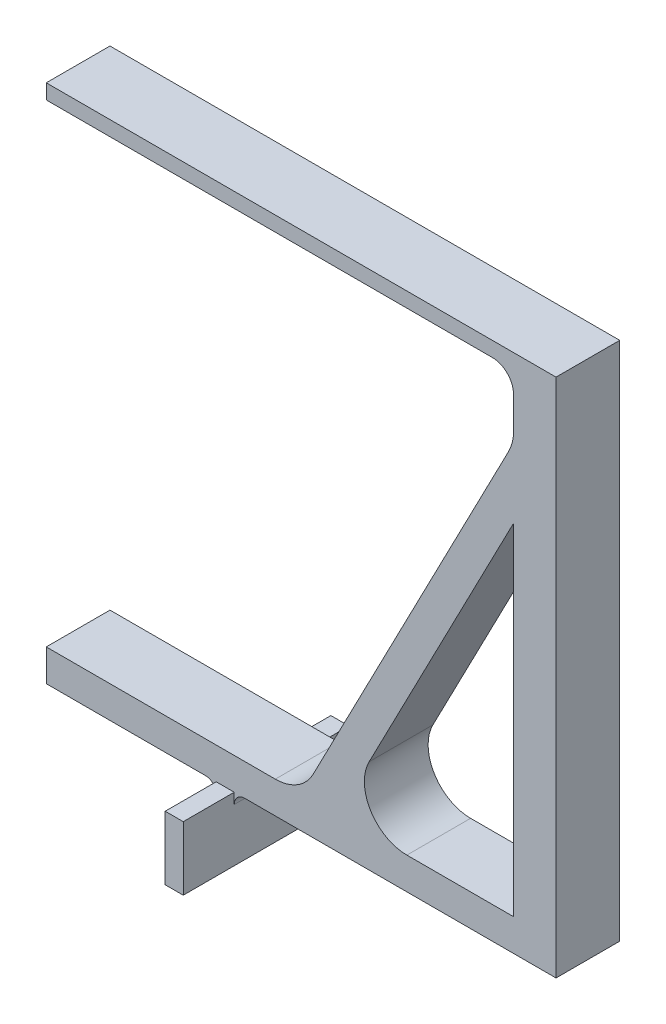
ISO-10303-21;
HEADER;
FILE_DESCRIPTION(('STEP AP214'),'2;1');
FILE_NAME('part.step','',(''),(''),'','','');
FILE_SCHEMA(('AUTOMOTIVE_DESIGN { 1 0 10303 214 1 1 1 1 }'));
ENDSEC;
DATA;
#1=APPLICATION_CONTEXT('core data for automotive mechanical design processes');
#2=APPLICATION_PROTOCOL_DEFINITION('international standard','automotive_design',2000,#1);
#3=PRODUCT_CONTEXT('',#1,'mechanical');
#4=PRODUCT('Part','Part','',(#3));
#5=PRODUCT_RELATED_PRODUCT_CATEGORY('part','',(#4));
#6=PRODUCT_DEFINITION_FORMATION('','',#4);
#7=PRODUCT_DEFINITION_CONTEXT('part definition',#1,'design');
#8=PRODUCT_DEFINITION('design','',#6,#7);
#9=PRODUCT_DEFINITION_SHAPE('','',#8);
#10=(LENGTH_UNIT() NAMED_UNIT(*) SI_UNIT(.MILLI.,.METRE.));
#11=(NAMED_UNIT(*) PLANE_ANGLE_UNIT() SI_UNIT($,.RADIAN.));
#12=(NAMED_UNIT(*) SI_UNIT($,.STERADIAN.) SOLID_ANGLE_UNIT());
#13=UNCERTAINTY_MEASURE_WITH_UNIT(LENGTH_MEASURE(1.E-05),#10,'distance_accuracy_value','');
#14=(GEOMETRIC_REPRESENTATION_CONTEXT(3) GLOBAL_UNCERTAINTY_ASSIGNED_CONTEXT((#13)) GLOBAL_UNIT_ASSIGNED_CONTEXT((#10,
#11,#12)) REPRESENTATION_CONTEXT('',''));
#15=CARTESIAN_POINT('',(0.,0.,0.));
#16=DIRECTION('',(0.,0.,1.));
#17=DIRECTION('',(1.,0.,0.));
#18=AXIS2_PLACEMENT_3D('',#15,#16,#17);
#19=CARTESIAN_POINT('',(0.,0.,3.));
#20=DIRECTION('',(0.,0.,1.));
#21=DIRECTION('',(1.,0.,0.));
#22=AXIS2_PLACEMENT_3D('',#19,#20,#21);
#23=PLANE('',#22);
#24=DIRECTION('',(-1.,0.,0.));
#25=VECTOR('',#24,1.);
#26=CARTESIAN_POINT('',(0.,3.,3.));
#27=LINE('',#26,#25);
#28=CARTESIAN_POINT('',(0.85,3.,3.));
#29=VERTEX_POINT('',#28);
#30=CARTESIAN_POINT('',(0.,3.,3.));
#31=VERTEX_POINT('',#30);
#32=EDGE_CURVE('E276',#29,#31,#27,.T.);
#33=ORIENTED_EDGE('',*,*,#32,.F.);
#34=DIRECTION('',(0.,1.,0.));
#35=VECTOR('',#34,1.);
#36=CARTESIAN_POINT('',(0.85,3.,3.));
#37=LINE('',#36,#35);
#38=CARTESIAN_POINT('',(0.85,2.5,3.));
#39=VERTEX_POINT('',#38);
#40=EDGE_CURVE('E401',#39,#29,#37,.T.);
#41=ORIENTED_EDGE('',*,*,#40,.F.);
#42=CARTESIAN_POINT('',(1.35,2.5,3.));
#43=DIRECTION('',(0.,0.,1.));
#44=DIRECTION('',(1.,0.,0.));
#45=AXIS2_PLACEMENT_3D('',#42,#43,#44);
#46=CIRCLE('',#45,0.5);
#47=CARTESIAN_POINT('',(1.35,3.,3.));
#48=VERTEX_POINT('',#47);
#49=EDGE_CURVE('E11',#39,#48,#46,.F.);
#50=ORIENTED_EDGE('',*,*,#49,.T.);
#51=DIRECTION('',(1.,0.,0.));
#52=VECTOR('',#51,1.);
#53=CARTESIAN_POINT('',(0.85,3.,3.));
#54=LINE('',#53,#52);
#55=CARTESIAN_POINT('',(16.,3.,3.));
#56=VERTEX_POINT('',#55);
#57=EDGE_CURVE('E222',#48,#56,#54,.T.);
#58=ORIENTED_EDGE('',*,*,#57,.T.);
#59=DIRECTION('',(0.,1.,0.));
#60=VECTOR('',#59,1.);
#61=CARTESIAN_POINT('',(16.,3.,3.));
#62=LINE('',#61,#60);
#63=CARTESIAN_POINT('',(16.,27.5,3.));
#64=VERTEX_POINT('',#63);
#65=EDGE_CURVE('E302',#56,#64,#62,.T.);
#66=ORIENTED_EDGE('',*,*,#65,.T.);
#67=DIRECTION('',(-1.,0.,0.));
#68=VECTOR('',#67,1.);
#69=CARTESIAN_POINT('',(14.,27.5,3.));
#70=LINE('',#69,#68);
#71=CARTESIAN_POINT('',(-8.,27.5,3.));
#72=VERTEX_POINT('',#71);
#73=EDGE_CURVE('E304',#64,#72,#70,.T.);
#74=ORIENTED_EDGE('',*,*,#73,.T.);
#75=DIRECTION('',(0.,-1.,0.));
#76=VECTOR('',#75,1.);
#77=CARTESIAN_POINT('',(-8.,27.5,3.));
#78=LINE('',#77,#76);
#79=CARTESIAN_POINT('',(-8.,26.8,3.));
#80=VERTEX_POINT('',#79);
#81=EDGE_CURVE('E306',#72,#80,#78,.T.);
#82=ORIENTED_EDGE('',*,*,#81,.T.);
#83=DIRECTION('',(1.,0.,0.));
#84=VECTOR('',#83,1.);
#85=CARTESIAN_POINT('',(14.,26.8,3.));
#86=LINE('',#85,#84);
#87=CARTESIAN_POINT('',(13.,26.8,3.));
#88=VERTEX_POINT('',#87);
#89=EDGE_CURVE('E308',#80,#88,#86,.T.);
#90=ORIENTED_EDGE('',*,*,#89,.T.);
#91=CARTESIAN_POINT('',(13.,25.8,3.));
#92=DIRECTION('',(0.,0.,1.));
#93=DIRECTION('',(1.,0.,0.));
#94=AXIS2_PLACEMENT_3D('',#91,#92,#93);
#95=CIRCLE('',#94,1.);
#96=CARTESIAN_POINT('',(14.,25.8,3.));
#97=VERTEX_POINT('',#96);
#98=EDGE_CURVE('E388',#88,#97,#95,.F.);
#99=ORIENTED_EDGE('',*,*,#98,.T.);
#100=DIRECTION('',(0.,-1.,0.));
#101=VECTOR('',#100,1.);
#102=CARTESIAN_POINT('',(14.,23.8,3.));
#103=LINE('',#102,#101);
#104=CARTESIAN_POINT('',(14.,24.2873670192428,3.));
#105=VERTEX_POINT('',#104);
#106=EDGE_CURVE('E311',#97,#105,#103,.T.);
#107=ORIENTED_EDGE('',*,*,#106,.T.);
#108=CARTESIAN_POINT('',(12.,24.2873670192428,3.));
#109=DIRECTION('',(0.,0.,1.));
#110=DIRECTION('',(1.,0.,0.));
#111=AXIS2_PLACEMENT_3D('',#108,#109,#110);
#112=CIRCLE('',#111,2.);
#113=CARTESIAN_POINT('',(13.7757874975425,23.367269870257,3.));
#114=VERTEX_POINT('',#113);
#115=EDGE_CURVE('E375',#105,#114,#112,.F.);
#116=ORIENTED_EDGE('',*,*,#115,.T.);
#117=DIRECTION('',(-0.460048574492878,-0.887893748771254,0.));
#118=VECTOR('',#117,1.);
#119=CARTESIAN_POINT('',(14.,23.8,3.));
#120=LINE('',#119,#118);
#121=CARTESIAN_POINT('',(4.55953515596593,5.57990285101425,3.));
#122=VERTEX_POINT('',#121);
#123=EDGE_CURVE('E313',#114,#122,#120,.T.);
#124=ORIENTED_EDGE('',*,*,#123,.T.);
#125=CARTESIAN_POINT('',(2.78374765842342,6.5,3.));
#126=DIRECTION('',(0.,0.,1.));
#127=DIRECTION('',(1.,0.,0.));
#128=AXIS2_PLACEMENT_3D('',#125,#126,#127);
#129=CIRCLE('',#128,2.);
#130=CARTESIAN_POINT('',(2.78374765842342,4.5,3.));
#131=VERTEX_POINT('',#130);
#132=EDGE_CURVE('E379',#122,#131,#129,.F.);
#133=ORIENTED_EDGE('',*,*,#132,.T.);
#134=DIRECTION('',(-1.,0.,0.));
#135=VECTOR('',#134,1.);
#136=CARTESIAN_POINT('',(-4.,4.5,3.));
#137=LINE('',#136,#135);
#138=CARTESIAN_POINT('',(-8.,4.5,3.));
#139=VERTEX_POINT('',#138);
#140=EDGE_CURVE('E316',#131,#139,#137,.T.);
#141=ORIENTED_EDGE('',*,*,#140,.T.);
#142=DIRECTION('',(0.,1.,0.));
#143=VECTOR('',#142,1.);
#144=CARTESIAN_POINT('',(-8.,3.,3.));
#145=LINE('',#144,#143);
#146=CARTESIAN_POINT('',(-8.,3.,3.));
#147=VERTEX_POINT('',#146);
#148=EDGE_CURVE('E233',#147,#139,#145,.T.);
#149=ORIENTED_EDGE('',*,*,#148,.F.);
#150=DIRECTION('',(1.,0.,0.));
#151=VECTOR('',#150,1.);
#152=CARTESIAN_POINT('',(0.,3.,3.));
#153=LINE('',#152,#151);
#154=CARTESIAN_POINT('',(-0.5,3.,3.));
#155=VERTEX_POINT('',#154);
#156=EDGE_CURVE('E229',#147,#155,#153,.T.);
#157=ORIENTED_EDGE('',*,*,#156,.T.);
#158=CARTESIAN_POINT('',(-0.5,2.5,3.));
#159=DIRECTION('',(0.,0.,1.));
#160=DIRECTION('',(1.,0.,0.));
#161=AXIS2_PLACEMENT_3D('',#158,#159,#160);
#162=CIRCLE('',#161,0.5);
#163=CARTESIAN_POINT('',(0.,2.5,3.));
#164=VERTEX_POINT('',#163);
#165=EDGE_CURVE('E408',#155,#164,#162,.F.);
#166=ORIENTED_EDGE('',*,*,#165,.T.);
#167=DIRECTION('',(0.,-1.,0.));
#168=VECTOR('',#167,1.);
#169=CARTESIAN_POINT('',(0.,3.,3.));
#170=LINE('',#169,#168);
#171=EDGE_CURVE('E60',#31,#164,#170,.T.);
#172=ORIENTED_EDGE('',*,*,#171,.F.);
#173=EDGE_LOOP('',(#33,#41,#50,#58,#66,#74,#82,#90,#99,#107,#116,#124,#133,#141,#149,#157,#166,#172));
#174=FACE_BOUND('',#173,.T.);
#175=DIRECTION('',(0.,1.,0.));
#176=VECTOR('',#175,1.);
#177=CARTESIAN_POINT('',(14.,4.5,3.));
#178=LINE('',#177,#176);
#179=CARTESIAN_POINT('',(14.,4.5,3.));
#180=VERTEX_POINT('',#179);
#181=CARTESIAN_POINT('',(14.,20.5394747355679,3.));
#182=VERTEX_POINT('',#181);
#183=EDGE_CURVE('E282',#180,#182,#178,.T.);
#184=ORIENTED_EDGE('',*,*,#183,.F.);
#185=DIRECTION('',(1.,0.,0.));
#186=VECTOR('',#185,1.);
#187=CARTESIAN_POINT('',(5.68939132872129,4.5,3.));
#188=LINE('',#187,#186);
#189=CARTESIAN_POINT('',(8.9781825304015,4.5,3.));
#190=VERTEX_POINT('',#189);
#191=EDGE_CURVE('E280',#190,#180,#188,.T.);
#192=ORIENTED_EDGE('',*,*,#191,.F.);
#193=CARTESIAN_POINT('',(8.9781825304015,6.5,3.));
#194=DIRECTION('',(0.,0.,1.));
#195=DIRECTION('',(1.,0.,0.));
#196=AXIS2_PLACEMENT_3D('',#193,#194,#195);
#197=CIRCLE('',#196,2.);
#198=CARTESIAN_POINT('',(7.20239503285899,7.42009714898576,3.));
#199=VERTEX_POINT('',#198);
#200=EDGE_CURVE('E370',#190,#199,#197,.F.);
#201=ORIENTED_EDGE('',*,*,#200,.T.);
#202=DIRECTION('',(-0.460048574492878,-0.887893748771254,0.));
#203=VECTOR('',#202,1.);
#204=CARTESIAN_POINT('',(5.68939132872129,4.5,3.));
#205=LINE('',#204,#203);
#206=EDGE_CURVE('E286',#182,#199,#205,.T.);
#207=ORIENTED_EDGE('',*,*,#206,.F.);
#208=EDGE_LOOP('',(#184,#192,#201,#207));
#209=FACE_BOUND('',#208,.T.);
#210=ADVANCED_FACE('F37',(#174,#209),#23,.T.);
#211=CARTESIAN_POINT('',(0.,0.,0.));
#212=DIRECTION('',(0.,0.,1.));
#213=DIRECTION('',(1.,0.,0.));
#214=AXIS2_PLACEMENT_3D('',#211,#212,#213);
#215=PLANE('',#214);
#216=DIRECTION('',(1.,0.,0.));
#217=VECTOR('',#216,1.);
#218=CARTESIAN_POINT('',(0.85,3.,0.));
#219=LINE('',#218,#217);
#220=CARTESIAN_POINT('',(1.35,3.,0.));
#221=VERTEX_POINT('',#220);
#222=CARTESIAN_POINT('',(16.,3.,0.));
#223=VERTEX_POINT('',#222);
#224=EDGE_CURVE('E300',#221,#223,#219,.T.);
#225=ORIENTED_EDGE('',*,*,#224,.F.);
#226=CARTESIAN_POINT('',(1.35,2.5,0.));
#227=DIRECTION('',(0.,0.,1.));
#228=DIRECTION('',(1.,0.,0.));
#229=AXIS2_PLACEMENT_3D('',#226,#227,#228);
#230=CIRCLE('',#229,0.5);
#231=CARTESIAN_POINT('',(0.85,2.5,0.));
#232=VERTEX_POINT('',#231);
#233=EDGE_CURVE('E45',#221,#232,#230,.T.);
#234=ORIENTED_EDGE('',*,*,#233,.T.);
#235=DIRECTION('',(0.,-1.,0.));
#236=VECTOR('',#235,1.);
#237=CARTESIAN_POINT('',(0.85,0.,0.));
#238=LINE('',#237,#236);
#239=CARTESIAN_POINT('',(0.85,3.,0.));
#240=VERTEX_POINT('',#239);
#241=EDGE_CURVE('E52',#240,#232,#238,.T.);
#242=ORIENTED_EDGE('',*,*,#241,.F.);
#243=DIRECTION('',(-1.,0.,0.));
#244=VECTOR('',#243,1.);
#245=CARTESIAN_POINT('',(0.,3.,0.));
#246=LINE('',#245,#244);
#247=CARTESIAN_POINT('',(0.,3.,0.));
#248=VERTEX_POINT('',#247);
#249=EDGE_CURVE('E271',#240,#248,#246,.T.);
#250=ORIENTED_EDGE('',*,*,#249,.T.);
#251=DIRECTION('',(0.,1.,0.));
#252=VECTOR('',#251,1.);
#253=CARTESIAN_POINT('',(0.,0.,0.));
#254=LINE('',#253,#252);
#255=CARTESIAN_POINT('',(0.,2.5,0.));
#256=VERTEX_POINT('',#255);
#257=EDGE_CURVE('E394',#256,#248,#254,.T.);
#258=ORIENTED_EDGE('',*,*,#257,.F.);
#259=CARTESIAN_POINT('',(-0.5,2.5,0.));
#260=DIRECTION('',(0.,0.,1.));
#261=DIRECTION('',(1.,0.,0.));
#262=AXIS2_PLACEMENT_3D('',#259,#260,#261);
#263=CIRCLE('',#262,0.5);
#264=CARTESIAN_POINT('',(-0.5,3.,0.));
#265=VERTEX_POINT('',#264);
#266=EDGE_CURVE('E219',#256,#265,#263,.T.);
#267=ORIENTED_EDGE('',*,*,#266,.T.);
#268=DIRECTION('',(1.,0.,0.));
#269=VECTOR('',#268,1.);
#270=CARTESIAN_POINT('',(0.,3.,0.));
#271=LINE('',#270,#269);
#272=CARTESIAN_POINT('',(-8.,3.,0.));
#273=VERTEX_POINT('',#272);
#274=EDGE_CURVE('E210',#273,#265,#271,.T.);
#275=ORIENTED_EDGE('',*,*,#274,.F.);
#276=DIRECTION('',(0.,-1.,0.));
#277=VECTOR('',#276,1.);
#278=CARTESIAN_POINT('',(-8.,3.,0.));
#279=LINE('',#278,#277);
#280=CARTESIAN_POINT('',(-8.,4.5,0.));
#281=VERTEX_POINT('',#280);
#282=EDGE_CURVE('E217',#281,#273,#279,.T.);
#283=ORIENTED_EDGE('',*,*,#282,.F.);
#284=DIRECTION('',(-1.,0.,0.));
#285=VECTOR('',#284,1.);
#286=CARTESIAN_POINT('',(-4.,4.5,0.));
#287=LINE('',#286,#285);
#288=CARTESIAN_POINT('',(2.78374765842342,4.5,0.));
#289=VERTEX_POINT('',#288);
#290=EDGE_CURVE('E223',#289,#281,#287,.T.);
#291=ORIENTED_EDGE('',*,*,#290,.F.);
#292=CARTESIAN_POINT('',(2.78374765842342,6.5,0.));
#293=DIRECTION('',(0.,0.,1.));
#294=DIRECTION('',(1.,0.,0.));
#295=AXIS2_PLACEMENT_3D('',#292,#293,#294);
#296=CIRCLE('',#295,2.);
#297=CARTESIAN_POINT('',(4.55953515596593,5.57990285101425,0.));
#298=VERTEX_POINT('',#297);
#299=EDGE_CURVE('E377',#289,#298,#296,.T.);
#300=ORIENTED_EDGE('',*,*,#299,.T.);
#301=DIRECTION('',(-0.460048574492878,-0.887893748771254,0.));
#302=VECTOR('',#301,1.);
#303=CARTESIAN_POINT('',(14.,23.8,0.));
#304=LINE('',#303,#302);
#305=CARTESIAN_POINT('',(13.7757874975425,23.367269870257,0.));
#306=VERTEX_POINT('',#305);
#307=EDGE_CURVE('E333',#306,#298,#304,.T.);
#308=ORIENTED_EDGE('',*,*,#307,.F.);
#309=CARTESIAN_POINT('',(12.,24.2873670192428,0.));
#310=DIRECTION('',(0.,0.,1.));
#311=DIRECTION('',(1.,0.,0.));
#312=AXIS2_PLACEMENT_3D('',#309,#310,#311);
#313=CIRCLE('',#312,2.);
#314=CARTESIAN_POINT('',(14.,24.2873670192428,0.));
#315=VERTEX_POINT('',#314);
#316=EDGE_CURVE('E372',#306,#315,#313,.T.);
#317=ORIENTED_EDGE('',*,*,#316,.T.);
#318=DIRECTION('',(0.,-1.,0.));
#319=VECTOR('',#318,1.);
#320=CARTESIAN_POINT('',(14.,23.8,0.));
#321=LINE('',#320,#319);
#322=CARTESIAN_POINT('',(14.,25.8,0.));
#323=VERTEX_POINT('',#322);
#324=EDGE_CURVE('E331',#323,#315,#321,.T.);
#325=ORIENTED_EDGE('',*,*,#324,.F.);
#326=CARTESIAN_POINT('',(13.,25.8,0.));
#327=DIRECTION('',(0.,0.,1.));
#328=DIRECTION('',(1.,0.,0.));
#329=AXIS2_PLACEMENT_3D('',#326,#327,#328);
#330=CIRCLE('',#329,1.);
#331=CARTESIAN_POINT('',(13.,26.8,0.));
#332=VERTEX_POINT('',#331);
#333=EDGE_CURVE('E386',#323,#332,#330,.T.);
#334=ORIENTED_EDGE('',*,*,#333,.T.);
#335=DIRECTION('',(1.,0.,0.));
#336=VECTOR('',#335,1.);
#337=CARTESIAN_POINT('',(14.,26.8,0.));
#338=LINE('',#337,#336);
#339=CARTESIAN_POINT('',(-8.,26.8,0.));
#340=VERTEX_POINT('',#339);
#341=EDGE_CURVE('E328',#340,#332,#338,.T.);
#342=ORIENTED_EDGE('',*,*,#341,.F.);
#343=DIRECTION('',(0.,-1.,0.));
#344=VECTOR('',#343,1.);
#345=CARTESIAN_POINT('',(-8.,27.5,0.));
#346=LINE('',#345,#344);
#347=CARTESIAN_POINT('',(-8.,27.5,0.));
#348=VERTEX_POINT('',#347);
#349=EDGE_CURVE('E326',#348,#340,#346,.T.);
#350=ORIENTED_EDGE('',*,*,#349,.F.);
#351=DIRECTION('',(-1.,0.,0.));
#352=VECTOR('',#351,1.);
#353=CARTESIAN_POINT('',(14.,27.5,0.));
#354=LINE('',#353,#352);
#355=CARTESIAN_POINT('',(16.,27.5,0.));
#356=VERTEX_POINT('',#355);
#357=EDGE_CURVE('E324',#356,#348,#354,.T.);
#358=ORIENTED_EDGE('',*,*,#357,.F.);
#359=DIRECTION('',(0.,1.,0.));
#360=VECTOR('',#359,1.);
#361=CARTESIAN_POINT('',(16.,3.,0.));
#362=LINE('',#361,#360);
#363=EDGE_CURVE('E321',#223,#356,#362,.T.);
#364=ORIENTED_EDGE('',*,*,#363,.F.);
#365=EDGE_LOOP('',(#225,#234,#242,#250,#258,#267,#275,#283,#291,#300,#308,#317,#325,#334,#342,
#350,#358,#364));
#366=FACE_BOUND('',#365,.T.);
#367=DIRECTION('',(-0.460048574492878,-0.887893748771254,0.));
#368=VECTOR('',#367,1.);
#369=CARTESIAN_POINT('',(5.68939132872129,4.5,0.));
#370=LINE('',#369,#368);
#371=CARTESIAN_POINT('',(14.,20.5394747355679,0.));
#372=VERTEX_POINT('',#371);
#373=CARTESIAN_POINT('',(7.20239503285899,7.42009714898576,0.));
#374=VERTEX_POINT('',#373);
#375=EDGE_CURVE('E283',#372,#374,#370,.T.);
#376=ORIENTED_EDGE('',*,*,#375,.T.);
#377=CARTESIAN_POINT('',(8.9781825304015,6.5,0.));
#378=DIRECTION('',(0.,0.,1.));
#379=DIRECTION('',(1.,0.,0.));
#380=AXIS2_PLACEMENT_3D('',#377,#378,#379);
#381=CIRCLE('',#380,2.);
#382=CARTESIAN_POINT('',(8.9781825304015,4.5,0.));
#383=VERTEX_POINT('',#382);
#384=EDGE_CURVE('E368',#374,#383,#381,.T.);
#385=ORIENTED_EDGE('',*,*,#384,.T.);
#386=DIRECTION('',(1.,0.,0.));
#387=VECTOR('',#386,1.);
#388=CARTESIAN_POINT('',(5.68939132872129,4.5,0.));
#389=LINE('',#388,#387);
#390=CARTESIAN_POINT('',(14.,4.5,0.));
#391=VERTEX_POINT('',#390);
#392=EDGE_CURVE('E279',#383,#391,#389,.T.);
#393=ORIENTED_EDGE('',*,*,#392,.T.);
#394=DIRECTION('',(0.,1.,0.));
#395=VECTOR('',#394,1.);
#396=CARTESIAN_POINT('',(14.,4.5,0.));
#397=LINE('',#396,#395);
#398=EDGE_CURVE('E291',#391,#372,#397,.T.);
#399=ORIENTED_EDGE('',*,*,#398,.T.);
#400=EDGE_LOOP('',(#376,#385,#393,#399));
#401=FACE_BOUND('',#400,.T.);
#402=ADVANCED_FACE('F213',(#366,#401),#215,.F.);
#403=CARTESIAN_POINT('',(0.85,3.,3.));
#404=DIRECTION('',(-1.,0.,0.));
#405=DIRECTION('',(0.,-1.,0.));
#406=AXIS2_PLACEMENT_3D('',#403,#404,#405);
#407=PLANE('',#406);
#408=DIRECTION('',(0.,0.,1.));
#409=VECTOR('',#408,1.);
#410=CARTESIAN_POINT('',(0.85,3.,-2.4));
#411=LINE('',#410,#409);
#412=CARTESIAN_POINT('',(0.85,3.,-2.4));
#413=VERTEX_POINT('',#412);
#414=EDGE_CURVE('E273',#413,#240,#411,.T.);
#415=ORIENTED_EDGE('',*,*,#414,.T.);
#416=ORIENTED_EDGE('',*,*,#241,.T.);
#417=DIRECTION('',(0.,0.,-1.));
#418=VECTOR('',#417,1.);
#419=CARTESIAN_POINT('',(0.85,2.5,3.));
#420=LINE('',#419,#418);
#421=EDGE_CURVE('E403',#232,#39,#420,.F.);
#422=ORIENTED_EDGE('',*,*,#421,.T.);
#423=ORIENTED_EDGE('',*,*,#40,.T.);
#424=CARTESIAN_POINT('',(0.85,3.,5.4));
#425=VERTEX_POINT('',#424);
#426=EDGE_CURVE('E267',#29,#425,#411,.T.);
#427=ORIENTED_EDGE('',*,*,#426,.T.);
#428=DIRECTION('',(0.,1.,0.));
#429=VECTOR('',#428,1.);
#430=CARTESIAN_POINT('',(0.85,0.,5.4));
#431=LINE('',#430,#429);
#432=CARTESIAN_POINT('',(0.85,0.,5.4));
#433=VERTEX_POINT('',#432);
#434=EDGE_CURVE('E249',#433,#425,#431,.T.);
#435=ORIENTED_EDGE('',*,*,#434,.F.);
#436=DIRECTION('',(0.,0.,-1.));
#437=VECTOR('',#436,1.);
#438=CARTESIAN_POINT('',(0.85,0.,3.));
#439=LINE('',#438,#437);
#440=CARTESIAN_POINT('',(0.85,0.,-2.4));
#441=VERTEX_POINT('',#440);
#442=EDGE_CURVE('E319',#433,#441,#439,.T.);
#443=ORIENTED_EDGE('',*,*,#442,.T.);
#444=DIRECTION('',(0.,1.,0.));
#445=VECTOR('',#444,1.);
#446=CARTESIAN_POINT('',(0.85,0.,-2.4));
#447=LINE('',#446,#445);
#448=EDGE_CURVE('E261',#441,#413,#447,.T.);
#449=ORIENTED_EDGE('',*,*,#448,.T.);
#450=EDGE_LOOP('',(#415,#416,#422,#423,#427,#435,#443,#449));
#451=FACE_BOUND('',#450,.T.);
#452=ADVANCED_FACE('F414',(#451),#407,.F.);
#453=CARTESIAN_POINT('',(0.85,3.,3.));
#454=DIRECTION('',(0.,1.,0.));
#455=DIRECTION('',(0.,0.,1.));
#456=AXIS2_PLACEMENT_3D('',#453,#454,#455);
#457=PLANE('',#456);
#458=ORIENTED_EDGE('',*,*,#57,.F.);
#459=DIRECTION('',(0.,0.,-1.));
#460=VECTOR('',#459,1.);
#461=CARTESIAN_POINT('',(1.35,3.,0.));
#462=LINE('',#461,#460);
#463=EDGE_CURVE('E398',#48,#221,#462,.T.);
#464=ORIENTED_EDGE('',*,*,#463,.T.);
#465=ORIENTED_EDGE('',*,*,#224,.T.);
#466=DIRECTION('',(0.,0.,-1.));
#467=VECTOR('',#466,1.);
#468=CARTESIAN_POINT('',(16.,3.,3.));
#469=LINE('',#468,#467);
#470=EDGE_CURVE('E349',#56,#223,#469,.T.);
#471=ORIENTED_EDGE('',*,*,#470,.F.);
#472=EDGE_LOOP('',(#458,#464,#465,#471));
#473=FACE_BOUND('',#472,.T.);
#474=ADVANCED_FACE('F421',(#473),#457,.F.);
#475=CARTESIAN_POINT('',(16.,3.,3.));
#476=DIRECTION('',(-1.,0.,0.));
#477=DIRECTION('',(0.,-1.,0.));
#478=AXIS2_PLACEMENT_3D('',#475,#476,#477);
#479=PLANE('',#478);
#480=ORIENTED_EDGE('',*,*,#363,.T.);
#481=DIRECTION('',(0.,0.,-1.));
#482=VECTOR('',#481,1.);
#483=CARTESIAN_POINT('',(16.,27.5,3.));
#484=LINE('',#483,#482);
#485=EDGE_CURVE('E346',#64,#356,#484,.T.);
#486=ORIENTED_EDGE('',*,*,#485,.F.);
#487=ORIENTED_EDGE('',*,*,#65,.F.);
#488=ORIENTED_EDGE('',*,*,#470,.T.);
#489=EDGE_LOOP('',(#480,#486,#487,#488));
#490=FACE_BOUND('',#489,.T.);
#491=ADVANCED_FACE('F425',(#490),#479,.F.);
#492=CARTESIAN_POINT('',(14.,27.5,3.));
#493=DIRECTION('',(0.,-1.,0.));
#494=DIRECTION('',(0.,0.,-1.));
#495=AXIS2_PLACEMENT_3D('',#492,#493,#494);
#496=PLANE('',#495);
#497=ORIENTED_EDGE('',*,*,#357,.T.);
#498=DIRECTION('',(0.,0.,-1.));
#499=VECTOR('',#498,1.);
#500=CARTESIAN_POINT('',(-8.,27.5,3.));
#501=LINE('',#500,#499);
#502=EDGE_CURVE('E343',#72,#348,#501,.T.);
#503=ORIENTED_EDGE('',*,*,#502,.F.);
#504=ORIENTED_EDGE('',*,*,#73,.F.);
#505=ORIENTED_EDGE('',*,*,#485,.T.);
#506=EDGE_LOOP('',(#497,#503,#504,#505));
#507=FACE_BOUND('',#506,.T.);
#508=ADVANCED_FACE('F431',(#507),#496,.F.);
#509=CARTESIAN_POINT('',(-8.,27.5,3.));
#510=DIRECTION('',(1.,0.,0.));
#511=DIRECTION('',(0.,0.,-1.));
#512=AXIS2_PLACEMENT_3D('',#509,#510,#511);
#513=PLANE('',#512);
#514=ORIENTED_EDGE('',*,*,#349,.T.);
#515=DIRECTION('',(0.,0.,-1.));
#516=VECTOR('',#515,1.);
#517=CARTESIAN_POINT('',(-8.,26.8,3.));
#518=LINE('',#517,#516);
#519=EDGE_CURVE('E340',#80,#340,#518,.T.);
#520=ORIENTED_EDGE('',*,*,#519,.F.);
#521=ORIENTED_EDGE('',*,*,#81,.F.);
#522=ORIENTED_EDGE('',*,*,#502,.T.);
#523=EDGE_LOOP('',(#514,#520,#521,#522));
#524=FACE_BOUND('',#523,.T.);
#525=ADVANCED_FACE('F434',(#524),#513,.F.);
#526=CARTESIAN_POINT('',(14.,26.8,3.));
#527=DIRECTION('',(0.,1.,0.));
#528=DIRECTION('',(-1.,0.,0.));
#529=AXIS2_PLACEMENT_3D('',#526,#527,#528);
#530=PLANE('',#529);
#531=ORIENTED_EDGE('',*,*,#341,.T.);
#532=DIRECTION('',(0.,0.,-1.));
#533=VECTOR('',#532,1.);
#534=CARTESIAN_POINT('',(13.,26.8,3.));
#535=LINE('',#534,#533);
#536=EDGE_CURVE('E384',#332,#88,#535,.F.);
#537=ORIENTED_EDGE('',*,*,#536,.T.);
#538=ORIENTED_EDGE('',*,*,#89,.F.);
#539=ORIENTED_EDGE('',*,*,#519,.T.);
#540=EDGE_LOOP('',(#531,#537,#538,#539));
#541=FACE_BOUND('',#540,.T.);
#542=ADVANCED_FACE('F438',(#541),#530,.F.);
#543=CARTESIAN_POINT('',(14.,23.8,3.));
#544=DIRECTION('',(1.,0.,0.));
#545=DIRECTION('',(0.,1.,0.));
#546=AXIS2_PLACEMENT_3D('',#543,#544,#545);
#547=PLANE('',#546);
#548=ORIENTED_EDGE('',*,*,#106,.F.);
#549=DIRECTION('',(0.,0.,-1.));
#550=VECTOR('',#549,1.);
#551=CARTESIAN_POINT('',(14.,25.8,0.));
#552=LINE('',#551,#550);
#553=EDGE_CURVE('E381',#97,#323,#552,.T.);
#554=ORIENTED_EDGE('',*,*,#553,.T.);
#555=ORIENTED_EDGE('',*,*,#324,.T.);
#556=DIRECTION('',(0.,0.,-1.));
#557=VECTOR('',#556,1.);
#558=CARTESIAN_POINT('',(14.,24.2873670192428,3.));
#559=LINE('',#558,#557);
#560=EDGE_CURVE('E362',#315,#105,#559,.F.);
#561=ORIENTED_EDGE('',*,*,#560,.T.);
#562=EDGE_LOOP('',(#548,#554,#555,#561));
#563=FACE_BOUND('',#562,.T.);
#564=ADVANCED_FACE('F447',(#563),#547,.F.);
#565=CARTESIAN_POINT('',(14.,23.8,3.));
#566=DIRECTION('',(0.887893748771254,-0.460048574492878,0.));
#567=DIRECTION('',(0.460048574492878,0.887893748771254,0.));
#568=AXIS2_PLACEMENT_3D('',#565,#566,#567);
#569=PLANE('',#568);
#570=ORIENTED_EDGE('',*,*,#123,.F.);
#571=DIRECTION('',(0.,0.,-1.));
#572=VECTOR('',#571,1.);
#573=CARTESIAN_POINT('',(13.7757874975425,23.367269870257,0.));
#574=LINE('',#573,#572);
#575=EDGE_CURVE('E359',#114,#306,#574,.T.);
#576=ORIENTED_EDGE('',*,*,#575,.T.);
#577=ORIENTED_EDGE('',*,*,#307,.T.);
#578=DIRECTION('',(0.,0.,-1.));
#579=VECTOR('',#578,1.);
#580=CARTESIAN_POINT('',(4.55953515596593,5.57990285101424,3.));
#581=LINE('',#580,#579);
#582=EDGE_CURVE('E357',#298,#122,#581,.F.);
#583=ORIENTED_EDGE('',*,*,#582,.T.);
#584=EDGE_LOOP('',(#570,#576,#577,#583));
#585=FACE_BOUND('',#584,.T.);
#586=ADVANCED_FACE('F457',(#585),#569,.F.);
#587=CARTESIAN_POINT('',(-4.,4.5,3.));
#588=DIRECTION('',(0.,-1.,0.));
#589=DIRECTION('',(0.,0.,-1.));
#590=AXIS2_PLACEMENT_3D('',#587,#588,#589);
#591=PLANE('',#590);
#592=ORIENTED_EDGE('',*,*,#140,.F.);
#593=DIRECTION('',(0.,0.,-1.));
#594=VECTOR('',#593,1.);
#595=CARTESIAN_POINT('',(2.78374765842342,4.5,0.));
#596=LINE('',#595,#594);
#597=EDGE_CURVE('E365',#131,#289,#596,.T.);
#598=ORIENTED_EDGE('',*,*,#597,.T.);
#599=ORIENTED_EDGE('',*,*,#290,.T.);
#600=DIRECTION('',(0.,0.,-1.));
#601=VECTOR('',#600,1.);
#602=CARTESIAN_POINT('',(-8.,4.5,0.));
#603=LINE('',#602,#601);
#604=EDGE_CURVE('E238',#139,#281,#603,.T.);
#605=ORIENTED_EDGE('',*,*,#604,.F.);
#606=EDGE_LOOP('',(#592,#598,#599,#605));
#607=FACE_BOUND('',#606,.T.);
#608=ADVANCED_FACE('F464',(#607),#591,.F.);
#609=CARTESIAN_POINT('',(0.,3.,3.));
#610=DIRECTION('',(0.,1.,0.));
#611=DIRECTION('',(-1.,0.,0.));
#612=AXIS2_PLACEMENT_3D('',#609,#610,#611);
#613=PLANE('',#612);
#614=ORIENTED_EDGE('',*,*,#274,.T.);
#615=DIRECTION('',(0.,0.,-1.));
#616=VECTOR('',#615,1.);
#617=CARTESIAN_POINT('',(-0.5,3.,3.));
#618=LINE('',#617,#616);
#619=EDGE_CURVE('E396',#265,#155,#618,.F.);
#620=ORIENTED_EDGE('',*,*,#619,.T.);
#621=ORIENTED_EDGE('',*,*,#156,.F.);
#622=DIRECTION('',(0.,0.,1.));
#623=VECTOR('',#622,1.);
#624=CARTESIAN_POINT('',(-8.,3.,0.));
#625=LINE('',#624,#623);
#626=EDGE_CURVE('E226',#273,#147,#625,.T.);
#627=ORIENTED_EDGE('',*,*,#626,.F.);
#628=EDGE_LOOP('',(#614,#620,#621,#627));
#629=FACE_BOUND('',#628,.T.);
#630=ADVANCED_FACE('F227',(#629),#613,.F.);
#631=CARTESIAN_POINT('',(0.,3.,3.));
#632=DIRECTION('',(1.,0.,0.));
#633=DIRECTION('',(0.,0.,-1.));
#634=AXIS2_PLACEMENT_3D('',#631,#632,#633);
#635=PLANE('',#634);
#636=DIRECTION('',(0.,0.,-1.));
#637=VECTOR('',#636,1.);
#638=CARTESIAN_POINT('',(0.,2.5,0.));
#639=LINE('',#638,#637);
#640=EDGE_CURVE('E391',#164,#256,#639,.T.);
#641=ORIENTED_EDGE('',*,*,#640,.T.);
#642=ORIENTED_EDGE('',*,*,#257,.T.);
#643=DIRECTION('',(0.,0.,1.));
#644=VECTOR('',#643,1.);
#645=CARTESIAN_POINT('',(0.,3.,-2.4));
#646=LINE('',#645,#644);
#647=CARTESIAN_POINT('',(0.,3.,-2.4));
#648=VERTEX_POINT('',#647);
#649=EDGE_CURVE('E268',#648,#248,#646,.T.);
#650=ORIENTED_EDGE('',*,*,#649,.F.);
#651=DIRECTION('',(0.,-1.,0.));
#652=VECTOR('',#651,1.);
#653=CARTESIAN_POINT('',(0.,0.,-2.4));
#654=LINE('',#653,#652);
#655=CARTESIAN_POINT('',(0.,0.,-2.4));
#656=VERTEX_POINT('',#655);
#657=EDGE_CURVE('E255',#648,#656,#654,.T.);
#658=ORIENTED_EDGE('',*,*,#657,.T.);
#659=DIRECTION('',(0.,0.,-1.));
#660=VECTOR('',#659,1.);
#661=CARTESIAN_POINT('',(0.,0.,3.));
#662=LINE('',#661,#660);
#663=CARTESIAN_POINT('',(0.,0.,5.4));
#664=VERTEX_POINT('',#663);
#665=EDGE_CURVE('E338',#664,#656,#662,.T.);
#666=ORIENTED_EDGE('',*,*,#665,.F.);
#667=DIRECTION('',(0.,-1.,0.));
#668=VECTOR('',#667,1.);
#669=CARTESIAN_POINT('',(0.,0.,5.4));
#670=LINE('',#669,#668);
#671=CARTESIAN_POINT('',(0.,3.,5.4));
#672=VERTEX_POINT('',#671);
#673=EDGE_CURVE('E243',#672,#664,#670,.T.);
#674=ORIENTED_EDGE('',*,*,#673,.F.);
#675=EDGE_CURVE('E272',#31,#672,#646,.T.);
#676=ORIENTED_EDGE('',*,*,#675,.F.);
#677=ORIENTED_EDGE('',*,*,#171,.T.);
#678=EDGE_LOOP('',(#641,#642,#650,#658,#666,#674,#676,#677));
#679=FACE_BOUND('',#678,.T.);
#680=ADVANCED_FACE('F471',(#679),#635,.F.);
#681=CARTESIAN_POINT('',(0.,0.,3.));
#682=DIRECTION('',(0.,1.,0.));
#683=DIRECTION('',(0.,0.,1.));
#684=AXIS2_PLACEMENT_3D('',#681,#682,#683);
#685=PLANE('',#684);
#686=ORIENTED_EDGE('',*,*,#665,.T.);
#687=DIRECTION('',(1.,0.,0.));
#688=VECTOR('',#687,1.);
#689=CARTESIAN_POINT('',(0.,0.,-2.4));
#690=LINE('',#689,#688);
#691=EDGE_CURVE('E258',#656,#441,#690,.T.);
#692=ORIENTED_EDGE('',*,*,#691,.T.);
#693=ORIENTED_EDGE('',*,*,#442,.F.);
#694=DIRECTION('',(1.,0.,0.));
#695=VECTOR('',#694,1.);
#696=CARTESIAN_POINT('',(0.,0.,5.4));
#697=LINE('',#696,#695);
#698=EDGE_CURVE('E246',#664,#433,#697,.T.);
#699=ORIENTED_EDGE('',*,*,#698,.F.);
#700=EDGE_LOOP('',(#686,#692,#693,#699));
#701=FACE_BOUND('',#700,.T.);
#702=ADVANCED_FACE('F484',(#701),#685,.F.);
#703=CARTESIAN_POINT('',(5.68939132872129,4.5,3.));
#704=DIRECTION('',(0.,1.,0.));
#705=DIRECTION('',(0.,0.,1.));
#706=AXIS2_PLACEMENT_3D('',#703,#704,#705);
#707=PLANE('',#706);
#708=ORIENTED_EDGE('',*,*,#392,.F.);
#709=DIRECTION('',(0.,0.,-1.));
#710=VECTOR('',#709,1.);
#711=CARTESIAN_POINT('',(8.9781825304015,4.5,3.));
#712=LINE('',#711,#710);
#713=EDGE_CURVE('E355',#383,#190,#712,.F.);
#714=ORIENTED_EDGE('',*,*,#713,.T.);
#715=ORIENTED_EDGE('',*,*,#191,.T.);
#716=DIRECTION('',(0.,0.,-1.));
#717=VECTOR('',#716,1.);
#718=CARTESIAN_POINT('',(14.,4.5,3.));
#719=LINE('',#718,#717);
#720=EDGE_CURVE('E297',#180,#391,#719,.T.);
#721=ORIENTED_EDGE('',*,*,#720,.T.);
#722=EDGE_LOOP('',(#708,#714,#715,#721));
#723=FACE_BOUND('',#722,.T.);
#724=ADVANCED_FACE('F481',(#723),#707,.T.);
#725=CARTESIAN_POINT('',(14.,4.5,3.));
#726=DIRECTION('',(-1.,0.,0.));
#727=DIRECTION('',(0.,-1.,0.));
#728=AXIS2_PLACEMENT_3D('',#725,#726,#727);
#729=PLANE('',#728);
#730=ORIENTED_EDGE('',*,*,#398,.F.);
#731=ORIENTED_EDGE('',*,*,#720,.F.);
#732=ORIENTED_EDGE('',*,*,#183,.T.);
#733=DIRECTION('',(0.,0.,-1.));
#734=VECTOR('',#733,1.);
#735=CARTESIAN_POINT('',(14.,20.5394747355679,3.));
#736=LINE('',#735,#734);
#737=EDGE_CURVE('E289',#182,#372,#736,.T.);
#738=ORIENTED_EDGE('',*,*,#737,.T.);
#739=EDGE_LOOP('',(#730,#731,#732,#738));
#740=FACE_BOUND('',#739,.T.);
#741=ADVANCED_FACE('F525',(#740),#729,.T.);
#742=CARTESIAN_POINT('',(5.68939132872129,4.5,3.));
#743=DIRECTION('',(0.887893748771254,-0.460048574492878,0.));
#744=DIRECTION('',(0.460048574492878,0.887893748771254,0.));
#745=AXIS2_PLACEMENT_3D('',#742,#743,#744);
#746=PLANE('',#745);
#747=ORIENTED_EDGE('',*,*,#206,.T.);
#748=DIRECTION('',(0.,0.,-1.));
#749=VECTOR('',#748,1.);
#750=CARTESIAN_POINT('',(7.20239503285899,7.42009714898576,0.));
#751=LINE('',#750,#749);
#752=EDGE_CURVE('E352',#199,#374,#751,.T.);
#753=ORIENTED_EDGE('',*,*,#752,.T.);
#754=ORIENTED_EDGE('',*,*,#375,.F.);
#755=ORIENTED_EDGE('',*,*,#737,.F.);
#756=EDGE_LOOP('',(#747,#753,#754,#755));
#757=FACE_BOUND('',#756,.T.);
#758=ADVANCED_FACE('F522',(#757),#746,.T.);
#759=CARTESIAN_POINT('',(8.9781825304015,6.5,3.));
#760=DIRECTION('',(0.,0.,1.));
#761=DIRECTION('',(1.,0.,0.));
#762=AXIS2_PLACEMENT_3D('',#759,#760,#761);
#763=CYLINDRICAL_SURFACE('',#762,2.);
#764=ORIENTED_EDGE('',*,*,#200,.F.);
#765=ORIENTED_EDGE('',*,*,#713,.F.);
#766=ORIENTED_EDGE('',*,*,#384,.F.);
#767=ORIENTED_EDGE('',*,*,#752,.F.);
#768=EDGE_LOOP('',(#764,#765,#766,#767));
#769=FACE_BOUND('',#768,.T.);
#770=ADVANCED_FACE('F524',(#769),#763,.F.);
#771=CARTESIAN_POINT('',(12.,24.2873670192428,3.));
#772=DIRECTION('',(0.,0.,1.));
#773=DIRECTION('',(1.,0.,0.));
#774=AXIS2_PLACEMENT_3D('',#771,#772,#773);
#775=CYLINDRICAL_SURFACE('',#774,2.);
#776=ORIENTED_EDGE('',*,*,#115,.F.);
#777=ORIENTED_EDGE('',*,*,#560,.F.);
#778=ORIENTED_EDGE('',*,*,#316,.F.);
#779=ORIENTED_EDGE('',*,*,#575,.F.);
#780=EDGE_LOOP('',(#776,#777,#778,#779));
#781=FACE_BOUND('',#780,.T.);
#782=ADVANCED_FACE('F453',(#781),#775,.F.);
#783=CARTESIAN_POINT('',(2.78374765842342,6.5,3.));
#784=DIRECTION('',(0.,0.,1.));
#785=DIRECTION('',(1.,0.,0.));
#786=AXIS2_PLACEMENT_3D('',#783,#784,#785);
#787=CYLINDRICAL_SURFACE('',#786,2.);
#788=ORIENTED_EDGE('',*,*,#132,.F.);
#789=ORIENTED_EDGE('',*,*,#582,.F.);
#790=ORIENTED_EDGE('',*,*,#299,.F.);
#791=ORIENTED_EDGE('',*,*,#597,.F.);
#792=EDGE_LOOP('',(#788,#789,#790,#791));
#793=FACE_BOUND('',#792,.T.);
#794=ADVANCED_FACE('F460',(#793),#787,.F.);
#795=CARTESIAN_POINT('',(13.,25.8,3.));
#796=DIRECTION('',(0.,0.,1.));
#797=DIRECTION('',(1.,0.,0.));
#798=AXIS2_PLACEMENT_3D('',#795,#796,#797);
#799=CYLINDRICAL_SURFACE('',#798,1.);
#800=ORIENTED_EDGE('',*,*,#98,.F.);
#801=ORIENTED_EDGE('',*,*,#536,.F.);
#802=ORIENTED_EDGE('',*,*,#333,.F.);
#803=ORIENTED_EDGE('',*,*,#553,.F.);
#804=EDGE_LOOP('',(#800,#801,#802,#803));
#805=FACE_BOUND('',#804,.T.);
#806=ADVANCED_FACE('F444',(#805),#799,.F.);
#807=CARTESIAN_POINT('',(0.,0.,-2.4));
#808=DIRECTION('',(0.,0.,-1.));
#809=DIRECTION('',(-1.,0.,0.));
#810=AXIS2_PLACEMENT_3D('',#807,#808,#809);
#811=PLANE('',#810);
#812=ORIENTED_EDGE('',*,*,#657,.F.);
#813=DIRECTION('',(-1.,0.,0.));
#814=VECTOR('',#813,1.);
#815=CARTESIAN_POINT('',(0.,3.,-2.4));
#816=LINE('',#815,#814);
#817=EDGE_CURVE('E264',#413,#648,#816,.T.);
#818=ORIENTED_EDGE('',*,*,#817,.F.);
#819=ORIENTED_EDGE('',*,*,#448,.F.);
#820=ORIENTED_EDGE('',*,*,#691,.F.);
#821=EDGE_LOOP('',(#812,#818,#819,#820));
#822=FACE_BOUND('',#821,.T.);
#823=ADVANCED_FACE('F502',(#822),#811,.T.);
#824=CARTESIAN_POINT('',(0.,3.,-2.4));
#825=DIRECTION('',(0.,1.,0.));
#826=DIRECTION('',(0.,0.,1.));
#827=AXIS2_PLACEMENT_3D('',#824,#825,#826);
#828=PLANE('',#827);
#829=ORIENTED_EDGE('',*,*,#249,.F.);
#830=ORIENTED_EDGE('',*,*,#414,.F.);
#831=ORIENTED_EDGE('',*,*,#817,.T.);
#832=ORIENTED_EDGE('',*,*,#649,.T.);
#833=EDGE_LOOP('',(#829,#830,#831,#832));
#834=FACE_BOUND('',#833,.T.);
#835=ADVANCED_FACE('F497',(#834),#828,.T.);
#836=ORIENTED_EDGE('',*,*,#426,.F.);
#837=ORIENTED_EDGE('',*,*,#32,.T.);
#838=ORIENTED_EDGE('',*,*,#675,.T.);
#839=DIRECTION('',(-1.,0.,0.));
#840=VECTOR('',#839,1.);
#841=CARTESIAN_POINT('',(0.,3.,5.4));
#842=LINE('',#841,#840);
#843=EDGE_CURVE('E252',#425,#672,#842,.T.);
#844=ORIENTED_EDGE('',*,*,#843,.F.);
#845=EDGE_LOOP('',(#836,#837,#838,#844));
#846=FACE_BOUND('',#845,.T.);
#847=ADVANCED_FACE('F512',(#846),#828,.T.);
#848=CARTESIAN_POINT('',(0.,0.,5.4));
#849=DIRECTION('',(0.,0.,-1.));
#850=DIRECTION('',(-1.,0.,0.));
#851=AXIS2_PLACEMENT_3D('',#848,#849,#850);
#852=PLANE('',#851);
#853=ORIENTED_EDGE('',*,*,#673,.T.);
#854=ORIENTED_EDGE('',*,*,#698,.T.);
#855=ORIENTED_EDGE('',*,*,#434,.T.);
#856=ORIENTED_EDGE('',*,*,#843,.T.);
#857=EDGE_LOOP('',(#853,#854,#855,#856));
#858=FACE_BOUND('',#857,.T.);
#859=ADVANCED_FACE('F507',(#858),#852,.F.);
#860=CARTESIAN_POINT('',(-0.5,2.5,3.));
#861=DIRECTION('',(0.,0.,1.));
#862=DIRECTION('',(1.,0.,0.));
#863=AXIS2_PLACEMENT_3D('',#860,#861,#862);
#864=CYLINDRICAL_SURFACE('',#863,0.5);
#865=ORIENTED_EDGE('',*,*,#165,.F.);
#866=ORIENTED_EDGE('',*,*,#619,.F.);
#867=ORIENTED_EDGE('',*,*,#266,.F.);
#868=ORIENTED_EDGE('',*,*,#640,.F.);
#869=EDGE_LOOP('',(#865,#866,#867,#868));
#870=FACE_BOUND('',#869,.T.);
#871=ADVANCED_FACE('F495',(#870),#864,.F.);
#872=CARTESIAN_POINT('',(1.35,2.5,3.));
#873=DIRECTION('',(0.,0.,1.));
#874=DIRECTION('',(1.,0.,0.));
#875=AXIS2_PLACEMENT_3D('',#872,#873,#874);
#876=CYLINDRICAL_SURFACE('',#875,0.5);
#877=ORIENTED_EDGE('',*,*,#49,.F.);
#878=ORIENTED_EDGE('',*,*,#421,.F.);
#879=ORIENTED_EDGE('',*,*,#233,.F.);
#880=ORIENTED_EDGE('',*,*,#463,.F.);
#881=EDGE_LOOP('',(#877,#878,#879,#880));
#882=FACE_BOUND('',#881,.T.);
#883=ADVANCED_FACE('F39',(#882),#876,.F.);
#884=CARTESIAN_POINT('',(-8.,0.,0.));
#885=DIRECTION('',(1.,0.,0.));
#886=DIRECTION('',(0.,1.,0.));
#887=AXIS2_PLACEMENT_3D('',#884,#885,#886);
#888=PLANE('',#887);
#889=ORIENTED_EDGE('',*,*,#282,.T.);
#890=ORIENTED_EDGE('',*,*,#626,.T.);
#891=ORIENTED_EDGE('',*,*,#148,.T.);
#892=ORIENTED_EDGE('',*,*,#604,.T.);
#893=EDGE_LOOP('',(#889,#890,#891,#892));
#894=FACE_BOUND('',#893,.T.);
#895=ADVANCED_FACE('F236',(#894),#888,.F.);
#896=CLOSED_SHELL('',(#210,#402,#452,#474,#491,#508,#525,#542,#564,#586,#608,#630,#680,#702,
#724,#741,#758,#770,#782,#794,#806,#823,#835,#847,#859,#871,#883,#895));
#897=MANIFOLD_SOLID_BREP('B2',#896);
#898=ADVANCED_BREP_SHAPE_REPRESENTATION('',(#18,#897),#14);
#899=SHAPE_DEFINITION_REPRESENTATION(#9,#898);
ENDSEC;
END-ISO-10303-21;
